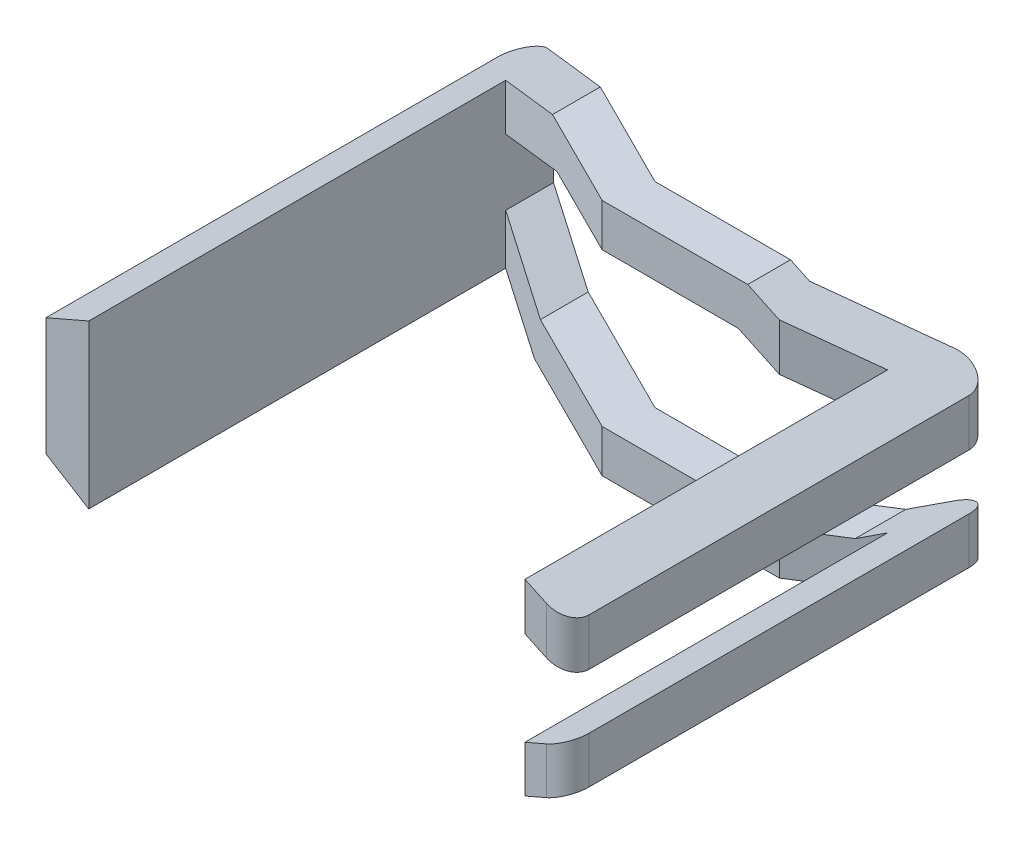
ISO-10303-21;
HEADER;
FILE_DESCRIPTION(('STEP AP214'),'2;1');
FILE_NAME('part.step','',(''),(''),'','','');
FILE_SCHEMA(('AUTOMOTIVE_DESIGN { 1 0 10303 214 1 1 1 1 }'));
ENDSEC;
DATA;
#1=APPLICATION_CONTEXT('core data for automotive mechanical design processes');
#2=APPLICATION_PROTOCOL_DEFINITION('international standard','automotive_design',2000,#1);
#3=PRODUCT_CONTEXT('',#1,'mechanical');
#4=PRODUCT('Part','Part','',(#3));
#5=PRODUCT_RELATED_PRODUCT_CATEGORY('part','',(#4));
#6=PRODUCT_DEFINITION_FORMATION('','',#4);
#7=PRODUCT_DEFINITION_CONTEXT('part definition',#1,'design');
#8=PRODUCT_DEFINITION('design','',#6,#7);
#9=PRODUCT_DEFINITION_SHAPE('','',#8);
#10=(LENGTH_UNIT() NAMED_UNIT(*) SI_UNIT(.MILLI.,.METRE.));
#11=(NAMED_UNIT(*) PLANE_ANGLE_UNIT() SI_UNIT($,.RADIAN.));
#12=(NAMED_UNIT(*) SI_UNIT($,.STERADIAN.) SOLID_ANGLE_UNIT());
#13=UNCERTAINTY_MEASURE_WITH_UNIT(LENGTH_MEASURE(1.E-05),#10,'distance_accuracy_value','');
#14=(GEOMETRIC_REPRESENTATION_CONTEXT(3) GLOBAL_UNCERTAINTY_ASSIGNED_CONTEXT((#13)) GLOBAL_UNIT_ASSIGNED_CONTEXT((#10,
#11,#12)) REPRESENTATION_CONTEXT('',''));
#15=CARTESIAN_POINT('',(0.,0.,0.));
#16=DIRECTION('',(0.,0.,1.));
#17=DIRECTION('',(1.,0.,0.));
#18=AXIS2_PLACEMENT_3D('',#15,#16,#17);
#19=CARTESIAN_POINT('',(0.,0.,125.));
#20=DIRECTION('',(0.,0.,1.));
#21=DIRECTION('',(1.,0.,0.));
#22=AXIS2_PLACEMENT_3D('',#19,#20,#21);
#23=PLANE('',#22);
#24=DIRECTION('',(0.,-1.,0.));
#25=VECTOR('',#24,1.);
#26=CARTESIAN_POINT('',(214.068694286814,95.6244972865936,125.));
#27=LINE('',#26,#25);
#28=CARTESIAN_POINT('',(214.068694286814,-10.360966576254,125.));
#29=VERTEX_POINT('',#28);
#30=CARTESIAN_POINT('',(214.068694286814,-32.1545691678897,125.));
#31=VERTEX_POINT('',#30);
#32=EDGE_CURVE('E570',#29,#31,#27,.T.);
#33=ORIENTED_EDGE('',*,*,#32,.T.);
#34=DIRECTION('',(0.917700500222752,0.397272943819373,0.));
#35=VECTOR('',#34,1.);
#36=CARTESIAN_POINT('',(45.5083961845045,-105.124395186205,125.));
#37=LINE('',#36,#35);
#38=CARTESIAN_POINT('',(224.068694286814,-27.8255648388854,125.));
#39=VERTEX_POINT('',#38);
#40=EDGE_CURVE('E468',#31,#39,#37,.T.);
#41=ORIENTED_EDGE('',*,*,#40,.T.);
#42=DIRECTION('',(0.,-1.,0.));
#43=VECTOR('',#42,1.);
#44=CARTESIAN_POINT('',(224.068694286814,95.6244972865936,125.));
#45=LINE('',#44,#43);
#46=CARTESIAN_POINT('',(224.068694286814,-6.03196224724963,125.));
#47=VERTEX_POINT('',#46);
#48=EDGE_CURVE('E575',#39,#47,#45,.F.);
#49=ORIENTED_EDGE('',*,*,#48,.T.);
#50=DIRECTION('',(0.917700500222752,0.397272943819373,0.));
#51=VECTOR('',#50,1.);
#52=CARTESIAN_POINT('',(37.562937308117,-86.7703851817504,125.));
#53=LINE('',#52,#51);
#54=EDGE_CURVE('E440',#29,#47,#53,.T.);
#55=ORIENTED_EDGE('',*,*,#54,.F.);
#56=EDGE_LOOP('',(#33,#41,#49,#55));
#57=FACE_BOUND('',#56,.T.);
#58=ADVANCED_FACE('F34',(#57),#23,.T.);
#59=CARTESIAN_POINT('',(214.068694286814,55.6673191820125,125.));
#60=VERTEX_POINT('',#59);
#61=CARTESIAN_POINT('',(214.068694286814,33.5647900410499,125.));
#62=VERTEX_POINT('',#61);
#63=EDGE_CURVE('E572',#60,#62,#27,.T.);
#64=ORIENTED_EDGE('',*,*,#63,.T.);
#65=DIRECTION('',(-0.904873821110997,0.425679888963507,0.));
#66=VECTOR('',#65,1.);
#67=CARTESIAN_POINT('',(51.7186753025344,109.939126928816,125.));
#68=LINE('',#67,#66);
#69=CARTESIAN_POINT('',(224.068694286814,28.8604889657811,125.));
#70=VERTEX_POINT('',#69);
#71=EDGE_CURVE('E443',#70,#62,#68,.T.);
#72=ORIENTED_EDGE('',*,*,#71,.F.);
#73=CARTESIAN_POINT('',(224.068694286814,50.9630181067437,125.));
#74=VERTEX_POINT('',#73);
#75=EDGE_CURVE('E573',#70,#74,#45,.F.);
#76=ORIENTED_EDGE('',*,*,#75,.T.);
#77=DIRECTION('',(-0.904873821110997,0.425679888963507,0.));
#78=VECTOR('',#77,1.);
#79=CARTESIAN_POINT('',(60.2322730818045,128.036603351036,125.));
#80=LINE('',#79,#78);
#81=EDGE_CURVE('E471',#74,#60,#80,.T.);
#82=ORIENTED_EDGE('',*,*,#81,.T.);
#83=EDGE_LOOP('',(#64,#72,#76,#82));
#84=FACE_BOUND('',#83,.T.);
#85=ADVANCED_FACE('F643',(#84),#23,.T.);
#86=DIRECTION('',(0.,-1.,0.));
#87=VECTOR('',#86,1.);
#88=CARTESIAN_POINT('',(10.,0.,125.));
#89=LINE('',#88,#87);
#90=CARTESIAN_POINT('',(10.,58.2565564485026,125.));
#91=VERTEX_POINT('',#90);
#92=CARTESIAN_POINT('',(10.,-17.8977166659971,125.));
#93=VERTEX_POINT('',#92);
#94=EDGE_CURVE('E56',#91,#93,#89,.T.);
#95=ORIENTED_EDGE('',*,*,#94,.F.);
#96=DIRECTION('',(-0.917700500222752,-0.397272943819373,0.));
#97=VECTOR('',#96,1.);
#98=CARTESIAN_POINT('',(-19.6607764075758,45.4163935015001,125.));
#99=LINE('',#98,#97);
#100=CARTESIAN_POINT('',(-10.,49.5985477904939,125.));
#101=VERTEX_POINT('',#100);
#102=EDGE_CURVE('E474',#91,#101,#99,.T.);
#103=ORIENTED_EDGE('',*,*,#102,.T.);
#104=DIRECTION('',(0.,-1.,0.));
#105=VECTOR('',#104,1.);
#106=CARTESIAN_POINT('',(-10.,0.,125.));
#107=LINE('',#106,#105);
#108=CARTESIAN_POINT('',(-10.,-5.5873048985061,125.));
#109=VERTEX_POINT('',#108);
#110=EDGE_CURVE('E476',#101,#109,#107,.T.);
#111=ORIENTED_EDGE('',*,*,#110,.T.);
#112=DIRECTION('',(0.851606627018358,-0.524181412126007,0.));
#113=VECTOR('',#112,1.);
#114=CARTESIAN_POINT('',(-5.24181412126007,-8.51606627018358,125.));
#115=LINE('',#114,#113);
#116=EDGE_CURVE('E465',#109,#93,#115,.T.);
#117=ORIENTED_EDGE('',*,*,#116,.T.);
#118=EDGE_LOOP('',(#95,#103,#111,#117));
#119=FACE_BOUND('',#118,.T.);
#120=ADVANCED_FACE('F645',(#119),#23,.T.);
#121=CARTESIAN_POINT('',(-5.24181412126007,-8.51606627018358,125.));
#122=DIRECTION('',(0.524181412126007,0.851606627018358,0.));
#123=DIRECTION('',(-0.851606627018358,0.524181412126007,0.));
#124=AXIS2_PLACEMENT_3D('',#121,#122,#123);
#125=PLANE('',#124);
#126=DIRECTION('',(-0.783597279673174,0.48232025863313,-0.39158967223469));
#127=VECTOR('',#126,1.);
#128=CARTESIAN_POINT('',(56.9497022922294,-46.7962250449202,-46.5990076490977));
#129=LINE('',#128,#127);
#130=CARTESIAN_POINT('',(36.7704872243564,-34.3755027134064,-56.6832338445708));
#131=VERTEX_POINT('',#130);
#132=CARTESIAN_POINT('',(10.,-17.8977166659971,-70.0613383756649));
#133=VERTEX_POINT('',#132);
#134=EDGE_CURVE('E49',#131,#133,#129,.T.);
#135=ORIENTED_EDGE('',*,*,#134,.T.);
#136=DIRECTION('',(0.,0.,1.));
#137=VECTOR('',#136,1.);
#138=CARTESIAN_POINT('',(10.,-17.8977166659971,125.));
#139=LINE('',#138,#137);
#140=EDGE_CURVE('E366',#133,#93,#139,.T.);
#141=ORIENTED_EDGE('',*,*,#140,.T.);
#142=ORIENTED_EDGE('',*,*,#116,.F.);
#143=DIRECTION('',(0.,0.,-1.));
#144=VECTOR('',#143,1.);
#145=CARTESIAN_POINT('',(-10.,-5.5873048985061,125.));
#146=LINE('',#145,#144);
#147=CARTESIAN_POINT('',(-10.,-5.5873048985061,-86.2378191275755));
#148=VERTEX_POINT('',#147);
#149=EDGE_CURVE('E478',#109,#148,#146,.T.);
#150=ORIENTED_EDGE('',*,*,#149,.T.);
#151=CARTESIAN_POINT('',(0.,-11.7425107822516,-86.2378191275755));
#152=DIRECTION('',(0.524181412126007,0.851606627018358,0.));
#153=DIRECTION('',(0.851606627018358,-0.524181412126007,0.));
#154=AXIS2_PLACEMENT_3D('',#151,#152,#153);
#155=ELLIPSE('',#154,11.7425107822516,10.);
#156=CARTESIAN_POINT('',(4.47022746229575,-14.494027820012,-95.1830450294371));
#157=VERTEX_POINT('',#156);
#158=EDGE_CURVE('E436',#157,#148,#155,.T.);
#159=ORIENTED_EDGE('',*,*,#158,.F.);
#160=DIRECTION('',(-0.783597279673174,0.48232025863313,-0.39158967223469));
#161=VECTOR('',#160,1.);
#162=CARTESIAN_POINT('',(63.8103138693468,-51.0190727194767,-65.5288264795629));
#163=LINE('',#162,#161);
#164=CARTESIAN_POINT('',(20.5240769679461,-24.3755027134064,-87.1604014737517));
#165=VERTEX_POINT('',#164);
#166=EDGE_CURVE('E362',#165,#157,#163,.T.);
#167=ORIENTED_EDGE('',*,*,#166,.F.);
#168=CARTESIAN_POINT('',(20.5240769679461,-24.3755027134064,-75.981253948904));
#169=DIRECTION('',(0.524181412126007,0.851606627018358,0.));
#170=DIRECTION('',(0.734485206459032,-0.452090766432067,0.506108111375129));
#171=AXIS2_PLACEMENT_3D('',#168,#169,#170);
#172=ELLIPSE('',#171,21.3268675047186,10.);
#173=CARTESIAN_POINT('',(36.7704872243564,-34.3755027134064,-67.8623813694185));
#174=VERTEX_POINT('',#173);
#175=EDGE_CURVE('E438',#174,#165,#172,.T.);
#176=ORIENTED_EDGE('',*,*,#175,.F.);
#177=DIRECTION('',(0.,0.,-1.));
#178=VECTOR('',#177,1.);
#179=CARTESIAN_POINT('',(36.7704872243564,-34.3755027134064,125.));
#180=LINE('',#179,#178);
#181=EDGE_CURVE('E299',#131,#174,#180,.T.);
#182=ORIENTED_EDGE('',*,*,#181,.F.);
#183=EDGE_LOOP('',(#135,#141,#142,#150,#159,#167,#176,#182));
#184=FACE_BOUND('',#183,.T.);
#185=ADVANCED_FACE('F36',(#184),#125,.F.);
#186=CARTESIAN_POINT('',(0.,-34.3755027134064,125.));
#187=DIRECTION('',(0.,1.,0.));
#188=DIRECTION('',(0.,0.,1.));
#189=AXIS2_PLACEMENT_3D('',#186,#187,#188);
#190=PLANE('',#189);
#191=DIRECTION('',(1.,0.,0.));
#192=VECTOR('',#191,1.);
#193=CARTESIAN_POINT('',(102.511333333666,-34.3755027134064,-25.0094899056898));
#194=LINE('',#193,#192);
#195=CARTESIAN_POINT('',(100.151779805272,-34.3755027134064,-25.0094899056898));
#196=VERTEX_POINT('',#195);
#197=CARTESIAN_POINT('',(183.037821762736,-34.3755027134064,-25.0094899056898));
#198=VERTEX_POINT('',#197);
#199=EDGE_CURVE('E550',#196,#198,#194,.T.);
#200=ORIENTED_EDGE('',*,*,#199,.F.);
#201=DIRECTION('',(0.894522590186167,0.,0.447022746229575));
#202=VECTOR('',#201,1.);
#203=CARTESIAN_POINT('',(-4.47022746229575,-34.3755027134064,-77.2925932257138));
#204=LINE('',#203,#202);
#205=EDGE_CURVE('E329',#131,#196,#204,.T.);
#206=ORIENTED_EDGE('',*,*,#205,.F.);
#207=ORIENTED_EDGE('',*,*,#181,.T.);
#208=DIRECTION('',(0.894522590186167,0.,0.447022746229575));
#209=VECTOR('',#208,1.);
#210=CARTESIAN_POINT('',(146.135168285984,-34.3755027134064,-13.209205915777));
#211=LINE('',#210,#209);
#212=CARTESIAN_POINT('',(102.511333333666,-34.3755027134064,-35.0094899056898));
#213=VERTEX_POINT('',#212);
#214=EDGE_CURVE('E289',#174,#213,#211,.T.);
#215=ORIENTED_EDGE('',*,*,#214,.T.);
#216=DIRECTION('',(1.,0.,0.));
#217=VECTOR('',#216,1.);
#218=CARTESIAN_POINT('',(164.899293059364,-34.3755027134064,-35.0094899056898));
#219=LINE('',#218,#217);
#220=CARTESIAN_POINT('',(180.140817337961,-34.3755027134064,-35.0094899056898));
#221=VERTEX_POINT('',#220);
#222=EDGE_CURVE('E277',#213,#221,#219,.T.);
#223=ORIENTED_EDGE('',*,*,#222,.T.);
#224=DIRECTION('',(0.845143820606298,0.,-0.53453898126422));
#225=VECTOR('',#224,1.);
#226=CARTESIAN_POINT('',(176.368632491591,-34.3755027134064,-32.623647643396));
#227=LINE('',#226,#225);
#228=CARTESIAN_POINT('',(208.93833779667,-34.3755027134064,-53.2234280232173));
#229=VERTEX_POINT('',#228);
#230=EDGE_CURVE('E288',#221,#229,#227,.T.);
#231=ORIENTED_EDGE('',*,*,#230,.T.);
#232=DIRECTION('',(0.,0.,-1.));
#233=VECTOR('',#232,1.);
#234=CARTESIAN_POINT('',(208.93833779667,-34.3755027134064,125.));
#235=LINE('',#234,#233);
#236=CARTESIAN_POINT('',(208.93833779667,-34.3755027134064,-41.3911223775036));
#237=VERTEX_POINT('',#236);
#238=EDGE_CURVE('E490',#237,#229,#235,.T.);
#239=ORIENTED_EDGE('',*,*,#238,.F.);
#240=DIRECTION('',(0.845143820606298,0.,-0.53453898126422));
#241=VECTOR('',#240,1.);
#242=CARTESIAN_POINT('',(185.486207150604,-34.3755027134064,-26.5580516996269));
#243=LINE('',#242,#241);
#244=EDGE_CURVE('E542',#198,#237,#243,.T.);
#245=ORIENTED_EDGE('',*,*,#244,.F.);
#246=EDGE_LOOP('',(#200,#206,#207,#215,#223,#231,#239,#245));
#247=FACE_BOUND('',#246,.T.);
#248=ADVANCED_FACE('F298',(#247),#190,.F.);
#249=CARTESIAN_POINT('',(45.5083961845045,-105.124395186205,125.));
#250=DIRECTION('',(-0.397272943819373,0.917700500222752,0.));
#251=DIRECTION('',(-0.917700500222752,-0.397272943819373,0.));
#252=AXIS2_PLACEMENT_3D('',#249,#250,#251);
#253=PLANE('',#252);
#254=ORIENTED_EDGE('',*,*,#40,.F.);
#255=DIRECTION('',(0.,0.,-1.));
#256=VECTOR('',#255,1.);
#257=CARTESIAN_POINT('',(214.068694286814,-32.1545691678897,125.));
#258=LINE('',#257,#256);
#259=CARTESIAN_POINT('',(214.068694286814,-32.1545691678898,-44.6359849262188));
#260=VERTEX_POINT('',#259);
#261=EDGE_CURVE('E432',#31,#260,#258,.T.);
#262=ORIENTED_EDGE('',*,*,#261,.T.);
#263=DIRECTION('',(-0.793691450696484,-0.34358937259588,0.501996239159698));
#264=VECTOR('',#263,1.);
#265=CARTESIAN_POINT('',(20.397542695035,-115.994894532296,77.8576990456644));
#266=LINE('',#265,#264);
#267=EDGE_CURVE('E410',#260,#237,#266,.T.);
#268=ORIENTED_EDGE('',*,*,#267,.T.);
#269=ORIENTED_EDGE('',*,*,#238,.T.);
#270=CARTESIAN_POINT('',(232.03833779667,-24.3755027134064,-67.8337821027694));
#271=DIRECTION('',(-0.397272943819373,0.917700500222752,0.));
#272=DIRECTION('',(0.755622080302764,0.327109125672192,-0.567481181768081));
#273=AXIS2_PLACEMENT_3D('',#270,#271,#272);
#274=ELLIPSE('',#273,29.7838194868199,10.);
#275=CARTESIAN_POINT('',(219.568977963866,-29.7734939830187,-69.9074879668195));
#276=VERTEX_POINT('',#275);
#277=EDGE_CURVE('E42',#276,#229,#274,.T.);
#278=ORIENTED_EDGE('',*,*,#277,.F.);
#279=CARTESIAN_POINT('',(225.326509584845,-27.2810560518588,-62.7931191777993));
#280=DIRECTION('',(-0.397272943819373,0.917700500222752,0.));
#281=DIRECTION('',(-0.917700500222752,-0.397272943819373,0.));
#282=AXIS2_PLACEMENT_3D('',#279,#280,#281);
#283=CIRCLE('',#282,9.48555008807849);
#284=CARTESIAN_POINT('',(232.03833779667,-24.3755027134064,-68.8333826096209));
#285=VERTEX_POINT('',#284);
#286=EDGE_CURVE('E11',#285,#276,#283,.T.);
#287=ORIENTED_EDGE('',*,*,#286,.F.);
#288=CARTESIAN_POINT('',(224.068694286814,-27.8255648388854,-62.7931191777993));
#289=DIRECTION('',(-0.397272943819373,0.917700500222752,0.));
#290=DIRECTION('',(-0.917700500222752,-0.397272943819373,0.));
#291=AXIS2_PLACEMENT_3D('',#288,#289,#290);
#292=ELLIPSE('',#291,10.8968012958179,10.);
#293=CARTESIAN_POINT('',(234.068694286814,-23.4965605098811,-62.7931191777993));
#294=VERTEX_POINT('',#293);
#295=EDGE_CURVE('E393',#294,#285,#292,.T.);
#296=ORIENTED_EDGE('',*,*,#295,.F.);
#297=DIRECTION('',(0.,0.,-1.));
#298=VECTOR('',#297,1.);
#299=CARTESIAN_POINT('',(234.068694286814,-23.4965605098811,125.));
#300=LINE('',#299,#298);
#301=CARTESIAN_POINT('',(234.068694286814,-23.4965605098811,115.));
#302=VERTEX_POINT('',#301);
#303=EDGE_CURVE('E425',#302,#294,#300,.T.);
#304=ORIENTED_EDGE('',*,*,#303,.F.);
#305=CARTESIAN_POINT('',(224.068694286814,-27.8255648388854,115.));
#306=DIRECTION('',(-0.397272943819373,0.917700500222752,0.));
#307=DIRECTION('',(-0.917700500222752,-0.397272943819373,0.));
#308=AXIS2_PLACEMENT_3D('',#305,#306,#307);
#309=ELLIPSE('',#308,10.8968012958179,10.);
#310=EDGE_CURVE('E400',#39,#302,#309,.T.);
#311=ORIENTED_EDGE('',*,*,#310,.F.);
#312=EDGE_LOOP('',(#254,#262,#268,#269,#278,#287,#296,#304,#311));
#313=FACE_BOUND('',#312,.T.);
#314=ADVANCED_FACE('F533',(#313),#253,.F.);
#315=CARTESIAN_POINT('',(60.2322730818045,128.036603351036,125.));
#316=DIRECTION('',(-0.425679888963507,-0.904873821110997,0.));
#317=DIRECTION('',(0.904873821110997,-0.425679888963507,0.));
#318=AXIS2_PLACEMENT_3D('',#315,#316,#317);
#319=PLANE('',#318);
#320=DIRECTION('',(0.785349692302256,-0.369452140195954,-0.496720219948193));
#321=VECTOR('',#320,1.);
#322=CARTESIAN_POINT('',(32.0136432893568,141.311496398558,70.5107145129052));
#323=LINE('',#322,#321);
#324=CARTESIAN_POINT('',(183.037821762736,70.2651758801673,-25.0094899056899));
#325=VERTEX_POINT('',#324);
#326=CARTESIAN_POINT('',(214.068694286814,55.6673191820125,-44.6359849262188));
#327=VERTEX_POINT('',#326);
#328=EDGE_CURVE('E408',#325,#327,#323,.T.);
#329=ORIENTED_EDGE('',*,*,#328,.T.);
#330=DIRECTION('',(0.,0.,1.));
#331=VECTOR('',#330,1.);
#332=CARTESIAN_POINT('',(214.068694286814,55.6673191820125,125.));
#333=LINE('',#332,#331);
#334=EDGE_CURVE('E430',#327,#60,#333,.T.);
#335=ORIENTED_EDGE('',*,*,#334,.T.);
#336=ORIENTED_EDGE('',*,*,#81,.F.);
#337=CARTESIAN_POINT('',(224.068694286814,50.9630181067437,115.));
#338=DIRECTION('',(-0.425679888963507,-0.904873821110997,0.));
#339=DIRECTION('',(0.904873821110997,-0.425679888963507,0.));
#340=AXIS2_PLACEMENT_3D('',#337,#338,#339);
#341=ELLIPSE('',#340,11.0512645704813,10.);
#342=CARTESIAN_POINT('',(234.068694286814,46.2587170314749,115.));
#343=VERTEX_POINT('',#342);
#344=EDGE_CURVE('E398',#343,#74,#341,.T.);
#345=ORIENTED_EDGE('',*,*,#344,.F.);
#346=DIRECTION('',(0.,0.,1.));
#347=VECTOR('',#346,1.);
#348=CARTESIAN_POINT('',(234.068694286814,46.2587170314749,125.));
#349=LINE('',#348,#347);
#350=CARTESIAN_POINT('',(234.068694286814,46.2587170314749,-62.7931191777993));
#351=VERTEX_POINT('',#350);
#352=EDGE_CURVE('E423',#351,#343,#349,.T.);
#353=ORIENTED_EDGE('',*,*,#352,.F.);
#354=CARTESIAN_POINT('',(224.068694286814,50.9630181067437,-62.7931191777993));
#355=DIRECTION('',(-0.425679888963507,-0.904873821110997,0.));
#356=DIRECTION('',(0.904873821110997,-0.425679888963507,0.));
#357=AXIS2_PLACEMENT_3D('',#354,#355,#356);
#358=ELLIPSE('',#357,11.0512645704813,10.);
#359=CARTESIAN_POINT('',(218.723304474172,53.4776504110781,-71.2445573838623));
#360=VERTEX_POINT('',#359);
#361=EDGE_CURVE('E391',#360,#351,#358,.T.);
#362=ORIENTED_EDGE('',*,*,#361,.F.);
#363=DIRECTION('',(0.785349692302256,-0.369452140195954,-0.496720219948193));
#364=VECTOR('',#363,1.);
#365=CARTESIAN_POINT('',(22.7821003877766,145.654292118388,52.6848958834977));
#366=LINE('',#365,#364);
#367=CARTESIAN_POINT('',(177.243812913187,72.9908520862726,-45.0094899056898));
#368=VERTEX_POINT('',#367);
#369=EDGE_CURVE('E418',#368,#360,#366,.T.);
#370=ORIENTED_EDGE('',*,*,#369,.F.);
#371=DIRECTION('',(0.904873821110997,-0.425679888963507,0.));
#372=VECTOR('',#371,1.);
#373=CARTESIAN_POINT('',(60.2322730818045,128.036603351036,-45.0094899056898));
#374=LINE('',#373,#372);
#375=CARTESIAN_POINT('',(168.285037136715,77.2053299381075,-45.0094899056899));
#376=VERTEX_POINT('',#375);
#377=EDGE_CURVE('E386',#376,#368,#374,.T.);
#378=ORIENTED_EDGE('',*,*,#377,.F.);
#379=DIRECTION('',(0.,0.,-1.));
#380=VECTOR('',#379,1.);
#381=CARTESIAN_POINT('',(168.285037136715,77.2053299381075,125.));
#382=LINE('',#381,#380);
#383=CARTESIAN_POINT('',(168.285037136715,77.2053299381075,-25.0094899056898));
#384=VERTEX_POINT('',#383);
#385=EDGE_CURVE('E487',#384,#376,#382,.T.);
#386=ORIENTED_EDGE('',*,*,#385,.F.);
#387=DIRECTION('',(0.904873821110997,-0.425679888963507,0.));
#388=VECTOR('',#387,1.);
#389=CARTESIAN_POINT('',(60.2322730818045,128.036603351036,-25.0094899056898));
#390=LINE('',#389,#388);
#391=EDGE_CURVE('E376',#384,#325,#390,.T.);
#392=ORIENTED_EDGE('',*,*,#391,.T.);
#393=EDGE_LOOP('',(#329,#335,#336,#345,#353,#362,#370,#378,#386,#392));
#394=FACE_BOUND('',#393,.T.);
#395=ADVANCED_FACE('F700',(#394),#319,.F.);
#396=CARTESIAN_POINT('',(0.,77.2053299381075,125.));
#397=DIRECTION('',(0.,-1.,0.));
#398=DIRECTION('',(0.,0.,-1.));
#399=AXIS2_PLACEMENT_3D('',#396,#397,#398);
#400=PLANE('',#399);
#401=DIRECTION('',(1.,0.,0.));
#402=VECTOR('',#401,1.);
#403=CARTESIAN_POINT('',(0.,77.2053299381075,-45.0094899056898));
#404=LINE('',#403,#402);
#405=CARTESIAN_POINT('',(104.87088686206,77.2053299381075,-45.0094899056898));
#406=VERTEX_POINT('',#405);
#407=EDGE_CURVE('E384',#406,#376,#404,.T.);
#408=ORIENTED_EDGE('',*,*,#407,.F.);
#409=DIRECTION('',(0.894522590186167,0.,0.447022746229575));
#410=VECTOR('',#409,1.);
#411=CARTESIAN_POINT('',(88.9383050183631,77.2053299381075,-52.9715319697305));
#412=LINE('',#411,#410);
#413=CARTESIAN_POINT('',(53.7716667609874,77.2053299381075,-70.5454729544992));
#414=VERTEX_POINT('',#413);
#415=EDGE_CURVE('E360',#414,#406,#412,.T.);
#416=ORIENTED_EDGE('',*,*,#415,.F.);
#417=DIRECTION('',(0.,0.,-1.));
#418=VECTOR('',#417,1.);
#419=CARTESIAN_POINT('',(53.7716667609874,77.2053299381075,125.));
#420=LINE('',#419,#418);
#421=CARTESIAN_POINT('',(53.7716667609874,77.2053299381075,-48.1871779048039));
#422=VERTEX_POINT('',#421);
#423=EDGE_CURVE('E484',#422,#414,#420,.T.);
#424=ORIENTED_EDGE('',*,*,#423,.F.);
#425=DIRECTION('',(0.894522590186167,0.,0.447022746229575));
#426=VECTOR('',#425,1.);
#427=CARTESIAN_POINT('',(79.9978500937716,77.2053299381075,-35.0810801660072));
#428=LINE('',#427,#426);
#429=CARTESIAN_POINT('',(100.151779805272,77.2053299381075,-25.0094899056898));
#430=VERTEX_POINT('',#429);
#431=EDGE_CURVE('E343',#422,#430,#428,.T.);
#432=ORIENTED_EDGE('',*,*,#431,.T.);
#433=DIRECTION('',(1.,0.,0.));
#434=VECTOR('',#433,1.);
#435=CARTESIAN_POINT('',(0.,77.2053299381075,-25.0094899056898));
#436=LINE('',#435,#434);
#437=EDGE_CURVE('E374',#430,#384,#436,.T.);
#438=ORIENTED_EDGE('',*,*,#437,.T.);
#439=ORIENTED_EDGE('',*,*,#385,.T.);
#440=EDGE_LOOP('',(#408,#416,#424,#432,#438,#439));
#441=FACE_BOUND('',#440,.T.);
#442=ADVANCED_FACE('F675',(#441),#400,.F.);
#443=CARTESIAN_POINT('',(-19.6607764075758,45.4163935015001,125.));
#444=DIRECTION('',(0.397272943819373,-0.917700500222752,0.));
#445=DIRECTION('',(0.917700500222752,0.397272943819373,0.));
#446=AXIS2_PLACEMENT_3D('',#443,#444,#445);
#447=PLANE('',#446);
#448=ORIENTED_EDGE('',*,*,#102,.F.);
#449=DIRECTION('',(0.,0.,-1.));
#450=VECTOR('',#449,1.);
#451=CARTESIAN_POINT('',(10.,58.2565564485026,125.));
#452=LINE('',#451,#450);
#453=CARTESIAN_POINT('',(10.,58.2565564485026,-70.0613383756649));
#454=VERTEX_POINT('',#453);
#455=EDGE_CURVE('E364',#91,#454,#452,.T.);
#456=ORIENTED_EDGE('',*,*,#455,.T.);
#457=DIRECTION('',(0.834163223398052,0.361109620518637,0.416859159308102));
#458=VECTOR('',#457,1.);
#459=CARTESIAN_POINT('',(53.3218251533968,77.0105933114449,-48.4119787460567));
#460=LINE('',#459,#458);
#461=EDGE_CURVE('E341',#454,#422,#460,.T.);
#462=ORIENTED_EDGE('',*,*,#461,.T.);
#463=ORIENTED_EDGE('',*,*,#423,.T.);
#464=DIRECTION('',(0.834163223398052,0.361109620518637,0.416859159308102));
#465=VECTOR('',#464,1.);
#466=CARTESIAN_POINT('',(61.0964433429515,80.3762288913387,-66.8850380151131));
#467=LINE('',#466,#465);
#468=CARTESIAN_POINT('',(4.47022746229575,55.8627155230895,-95.1830450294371));
#469=VERTEX_POINT('',#468);
#470=EDGE_CURVE('E358',#469,#414,#467,.T.);
#471=ORIENTED_EDGE('',*,*,#470,.F.);
#472=CARTESIAN_POINT('',(0.,53.9275521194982,-86.2378191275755));
#473=DIRECTION('',(0.397272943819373,-0.917700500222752,0.));
#474=DIRECTION('',(-0.917700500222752,-0.397272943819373,0.));
#475=AXIS2_PLACEMENT_3D('',#472,#473,#474);
#476=ELLIPSE('',#475,10.8968012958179,10.);
#477=CARTESIAN_POINT('',(-10.,49.5985477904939,-86.2378191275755));
#478=VERTEX_POINT('',#477);
#479=EDGE_CURVE('E434',#478,#469,#476,.T.);
#480=ORIENTED_EDGE('',*,*,#479,.F.);
#481=DIRECTION('',(0.,0.,-1.));
#482=VECTOR('',#481,1.);
#483=CARTESIAN_POINT('',(-10.,49.5985477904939,125.));
#484=LINE('',#483,#482);
#485=EDGE_CURVE('E481',#101,#478,#484,.T.);
#486=ORIENTED_EDGE('',*,*,#485,.F.);
#487=EDGE_LOOP('',(#448,#456,#462,#463,#471,#480,#486));
#488=FACE_BOUND('',#487,.T.);
#489=ADVANCED_FACE('F659',(#488),#447,.F.);
#490=CARTESIAN_POINT('',(-10.,0.,125.));
#491=DIRECTION('',(1.,0.,0.));
#492=DIRECTION('',(0.,0.,-1.));
#493=AXIS2_PLACEMENT_3D('',#490,#491,#492);
#494=PLANE('',#493);
#495=ORIENTED_EDGE('',*,*,#485,.T.);
#496=DIRECTION('',(0.,-1.,0.));
#497=VECTOR('',#496,1.);
#498=CARTESIAN_POINT('',(-10.,95.6244972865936,-86.2378191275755));
#499=LINE('',#498,#497);
#500=EDGE_CURVE('E521',#478,#148,#499,.T.);
#501=ORIENTED_EDGE('',*,*,#500,.T.);
#502=ORIENTED_EDGE('',*,*,#149,.F.);
#503=ORIENTED_EDGE('',*,*,#110,.F.);
#504=EDGE_LOOP('',(#495,#501,#502,#503));
#505=FACE_BOUND('',#504,.T.);
#506=ADVANCED_FACE('F730',(#505),#494,.F.);
#507=CARTESIAN_POINT('',(5.24181412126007,8.51606627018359,125.));
#508=DIRECTION('',(0.524181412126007,0.851606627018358,0.));
#509=DIRECTION('',(-0.851606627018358,0.524181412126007,0.));
#510=AXIS2_PLACEMENT_3D('',#507,#508,#509);
#511=PLANE('',#510);
#512=DIRECTION('',(0.,0.,-1.));
#513=VECTOR('',#512,1.);
#514=CARTESIAN_POINT('',(42.432396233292,-14.3755027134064,125.));
#515=LINE('',#514,#513);
#516=CARTESIAN_POINT('',(42.432396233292,-14.3755027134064,-53.8537892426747));
#517=VERTEX_POINT('',#516);
#518=CARTESIAN_POINT('',(42.432396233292,-14.3755027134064,-76.2120842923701));
#519=VERTEX_POINT('',#518);
#520=EDGE_CURVE('E462',#517,#519,#515,.T.);
#521=ORIENTED_EDGE('',*,*,#520,.T.);
#522=DIRECTION('',(-0.783597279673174,0.48232025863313,-0.39158967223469));
#523=VECTOR('',#522,1.);
#524=CARTESIAN_POINT('',(72.6863566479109,-32.997438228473,-61.0931721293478));
#525=LINE('',#524,#523);
#526=CARTESIAN_POINT('',(10.,5.58730489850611,-92.4196334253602));
#527=VERTEX_POINT('',#526);
#528=EDGE_CURVE('E352',#519,#527,#525,.T.);
#529=ORIENTED_EDGE('',*,*,#528,.T.);
#530=DIRECTION('',(0.,0.,-1.));
#531=VECTOR('',#530,1.);
#532=CARTESIAN_POINT('',(10.,5.58730489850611,125.));
#533=LINE('',#532,#531);
#534=CARTESIAN_POINT('',(10.,5.58730489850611,-70.0613383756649));
#535=VERTEX_POINT('',#534);
#536=EDGE_CURVE('E447',#535,#527,#533,.T.);
#537=ORIENTED_EDGE('',*,*,#536,.F.);
#538=DIRECTION('',(-0.783597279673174,0.48232025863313,-0.39158967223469));
#539=VECTOR('',#538,1.);
#540=CARTESIAN_POINT('',(65.8257450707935,-28.7745905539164,-42.1633532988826));
#541=LINE('',#540,#539);
#542=EDGE_CURVE('E338',#517,#535,#541,.T.);
#543=ORIENTED_EDGE('',*,*,#542,.F.);
#544=EDGE_LOOP('',(#521,#529,#537,#543));
#545=FACE_BOUND('',#544,.T.);
#546=ADVANCED_FACE('F721',(#545),#511,.T.);
#547=CARTESIAN_POINT('',(0.,-14.3755027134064,125.));
#548=DIRECTION('',(0.,1.,0.));
#549=DIRECTION('',(0.,0.,1.));
#550=AXIS2_PLACEMENT_3D('',#547,#548,#549);
#551=PLANE('',#550);
#552=DIRECTION('',(0.,0.,-1.));
#553=VECTOR('',#552,1.);
#554=CARTESIAN_POINT('',(204.795115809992,-14.3755027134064,125.));
#555=LINE('',#554,#553);
#556=CARTESIAN_POINT('',(204.795115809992,-14.3755027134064,-38.7706054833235));
#557=VERTEX_POINT('',#556);
#558=CARTESIAN_POINT('',(204.795115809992,-14.3755027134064,-62.435216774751));
#559=VERTEX_POINT('',#558);
#560=EDGE_CURVE('E459',#557,#559,#555,.T.);
#561=ORIENTED_EDGE('',*,*,#560,.T.);
#562=DIRECTION('',(-0.845143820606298,0.,0.53453898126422));
#563=VECTOR('',#562,1.);
#564=CARTESIAN_POINT('',(-26.1596656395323,-14.3755027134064,83.6397240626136));
#565=LINE('',#564,#563);
#566=CARTESIAN_POINT('',(177.243812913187,-14.3755027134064,-45.0094899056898));
#567=VERTEX_POINT('',#566);
#568=EDGE_CURVE('E415',#559,#567,#565,.T.);
#569=ORIENTED_EDGE('',*,*,#568,.T.);
#570=DIRECTION('',(-1.,0.,0.));
#571=VECTOR('',#570,1.);
#572=CARTESIAN_POINT('',(0.,-14.3755027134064,-45.0094899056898));
#573=LINE('',#572,#571);
#574=CARTESIAN_POINT('',(104.87088686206,-14.3755027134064,-45.0094899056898));
#575=VERTEX_POINT('',#574);
#576=EDGE_CURVE('E381',#567,#575,#573,.T.);
#577=ORIENTED_EDGE('',*,*,#576,.T.);
#578=DIRECTION('',(-0.894522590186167,0.,-0.447022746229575));
#579=VECTOR('',#578,1.);
#580=CARTESIAN_POINT('',(88.9383050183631,-14.3755027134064,-52.9715319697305));
#581=LINE('',#580,#579);
#582=EDGE_CURVE('E355',#575,#519,#581,.T.);
#583=ORIENTED_EDGE('',*,*,#582,.T.);
#584=ORIENTED_EDGE('',*,*,#520,.F.);
#585=DIRECTION('',(-0.894522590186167,0.,-0.447022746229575));
#586=VECTOR('',#585,1.);
#587=CARTESIAN_POINT('',(79.9978500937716,-14.3755027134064,-35.0810801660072));
#588=LINE('',#587,#586);
#589=CARTESIAN_POINT('',(100.151779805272,-14.3755027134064,-25.0094899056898));
#590=VERTEX_POINT('',#589);
#591=EDGE_CURVE('E335',#590,#517,#588,.T.);
#592=ORIENTED_EDGE('',*,*,#591,.F.);
#593=DIRECTION('',(-1.,0.,0.));
#594=VECTOR('',#593,1.);
#595=CARTESIAN_POINT('',(0.,-14.3755027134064,-25.0094899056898));
#596=LINE('',#595,#594);
#597=CARTESIAN_POINT('',(183.037821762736,-14.3755027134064,-25.0094899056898));
#598=VERTEX_POINT('',#597);
#599=EDGE_CURVE('E371',#598,#590,#596,.T.);
#600=ORIENTED_EDGE('',*,*,#599,.F.);
#601=DIRECTION('',(-0.845143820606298,0.,0.53453898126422));
#602=VECTOR('',#601,1.);
#603=CARTESIAN_POINT('',(-15.4688860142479,-14.3755027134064,100.54260047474));
#604=LINE('',#603,#602);
#605=EDGE_CURVE('E405',#557,#598,#604,.T.);
#606=ORIENTED_EDGE('',*,*,#605,.F.);
#607=EDGE_LOOP('',(#561,#569,#577,#583,#584,#592,#600,#606));
#608=FACE_BOUND('',#607,.T.);
#609=ADVANCED_FACE('F723',(#608),#551,.T.);
#610=CARTESIAN_POINT('',(37.562937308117,-86.7703851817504,125.));
#611=DIRECTION('',(-0.397272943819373,0.917700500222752,0.));
#612=DIRECTION('',(-0.917700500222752,-0.397272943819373,0.));
#613=AXIS2_PLACEMENT_3D('',#610,#611,#612);
#614=PLANE('',#613);
#615=DIRECTION('',(0.,0.,-1.));
#616=VECTOR('',#615,1.);
#617=CARTESIAN_POINT('',(214.068694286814,-10.360966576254,125.));
#618=LINE('',#617,#616);
#619=CARTESIAN_POINT('',(214.068694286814,-10.360966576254,-44.6359849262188));
#620=VERTEX_POINT('',#619);
#621=EDGE_CURVE('E427',#29,#620,#618,.T.);
#622=ORIENTED_EDGE('',*,*,#621,.F.);
#623=ORIENTED_EDGE('',*,*,#54,.T.);
#624=CARTESIAN_POINT('',(224.068694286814,-6.03196224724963,115.));
#625=DIRECTION('',(-0.397272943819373,0.917700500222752,0.));
#626=DIRECTION('',(-0.917700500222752,-0.397272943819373,0.));
#627=AXIS2_PLACEMENT_3D('',#624,#625,#626);
#628=ELLIPSE('',#627,10.8968012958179,10.);
#629=CARTESIAN_POINT('',(234.068694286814,-1.7029579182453,115.));
#630=VERTEX_POINT('',#629);
#631=EDGE_CURVE('E395',#47,#630,#628,.T.);
#632=ORIENTED_EDGE('',*,*,#631,.T.);
#633=DIRECTION('',(0.,0.,-1.));
#634=VECTOR('',#633,1.);
#635=CARTESIAN_POINT('',(234.068694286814,-1.7029579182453,125.));
#636=LINE('',#635,#634);
#637=CARTESIAN_POINT('',(234.068694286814,-1.7029579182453,-62.7931191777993));
#638=VERTEX_POINT('',#637);
#639=EDGE_CURVE('E420',#630,#638,#636,.T.);
#640=ORIENTED_EDGE('',*,*,#639,.T.);
#641=CARTESIAN_POINT('',(224.068694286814,-6.03196224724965,-62.7931191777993));
#642=DIRECTION('',(-0.397272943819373,0.917700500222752,0.));
#643=DIRECTION('',(-0.917700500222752,-0.397272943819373,0.));
#644=AXIS2_PLACEMENT_3D('',#641,#642,#643);
#645=ELLIPSE('',#644,10.8968012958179,10.);
#646=CARTESIAN_POINT('',(218.723304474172,-8.34598381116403,-71.2445573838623));
#647=VERTEX_POINT('',#646);
#648=EDGE_CURVE('E388',#638,#647,#645,.T.);
#649=ORIENTED_EDGE('',*,*,#648,.T.);
#650=DIRECTION('',(-0.793691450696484,-0.34358937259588,0.501996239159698));
#651=VECTOR('',#650,1.);
#652=CARTESIAN_POINT('',(5.02564724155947,-100.85579213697,63.9155481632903));
#653=LINE('',#652,#651);
#654=EDGE_CURVE('E412',#647,#559,#653,.T.);
#655=ORIENTED_EDGE('',*,*,#654,.T.);
#656=ORIENTED_EDGE('',*,*,#560,.F.);
#657=DIRECTION('',(-0.793691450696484,-0.34358937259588,0.501996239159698));
#658=VECTOR('',#657,1.);
#659=CARTESIAN_POINT('',(14.4543412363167,-96.774106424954,81.6166721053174));
#660=LINE('',#659,#658);
#661=EDGE_CURVE('E402',#620,#557,#660,.T.);
#662=ORIENTED_EDGE('',*,*,#661,.F.);
#663=EDGE_LOOP('',(#622,#623,#632,#640,#649,#655,#656,#662));
#664=FACE_BOUND('',#663,.T.);
#665=ADVANCED_FACE('F589',(#664),#614,.T.);
#666=CARTESIAN_POINT('',(51.7186753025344,109.939126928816,125.));
#667=DIRECTION('',(-0.425679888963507,-0.904873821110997,0.));
#668=DIRECTION('',(0.904873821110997,-0.425679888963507,0.));
#669=AXIS2_PLACEMENT_3D('',#666,#667,#668);
#670=PLANE('',#669);
#671=DIRECTION('',(0.,0.,1.));
#672=VECTOR('',#671,1.);
#673=CARTESIAN_POINT('',(214.068694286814,33.5647900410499,125.));
#674=LINE('',#673,#672);
#675=CARTESIAN_POINT('',(214.068694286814,33.5647900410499,-44.6359849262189));
#676=VERTEX_POINT('',#675);
#677=EDGE_CURVE('E518',#676,#62,#674,.T.);
#678=ORIENTED_EDGE('',*,*,#677,.F.);
#679=DIRECTION('',(0.785349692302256,-0.369452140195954,-0.496720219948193));
#680=VECTOR('',#679,1.);
#681=CARTESIAN_POINT('',(25.6006138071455,122.225849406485,74.5668457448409));
#682=LINE('',#681,#680);
#683=CARTESIAN_POINT('',(183.037821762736,48.1626467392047,-25.0094899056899));
#684=VERTEX_POINT('',#683);
#685=EDGE_CURVE('E515',#684,#676,#682,.T.);
#686=ORIENTED_EDGE('',*,*,#685,.F.);
#687=DIRECTION('',(0.904873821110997,-0.425679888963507,0.));
#688=VECTOR('',#687,1.);
#689=CARTESIAN_POINT('',(51.7186753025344,109.939126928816,-25.0094899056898));
#690=LINE('',#689,#688);
#691=CARTESIAN_POINT('',(163.81566090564,57.2053299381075,-25.0094899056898));
#692=VERTEX_POINT('',#691);
#693=EDGE_CURVE('E368',#692,#684,#690,.T.);
#694=ORIENTED_EDGE('',*,*,#693,.F.);
#695=DIRECTION('',(0.,0.,-1.));
#696=VECTOR('',#695,1.);
#697=CARTESIAN_POINT('',(163.81566090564,57.2053299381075,125.));
#698=LINE('',#697,#696);
#699=CARTESIAN_POINT('',(163.81566090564,57.2053299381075,-45.0094899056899));
#700=VERTEX_POINT('',#699);
#701=EDGE_CURVE('E456',#692,#700,#698,.T.);
#702=ORIENTED_EDGE('',*,*,#701,.T.);
#703=DIRECTION('',(0.904873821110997,-0.425679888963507,0.));
#704=VECTOR('',#703,1.);
#705=CARTESIAN_POINT('',(51.7186753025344,109.939126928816,-45.0094899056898));
#706=LINE('',#705,#704);
#707=CARTESIAN_POINT('',(177.243812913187,50.8883229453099,-45.0094899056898));
#708=VERTEX_POINT('',#707);
#709=EDGE_CURVE('E378',#700,#708,#706,.T.);
#710=ORIENTED_EDGE('',*,*,#709,.T.);
#711=DIRECTION('',(0.785349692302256,-0.369452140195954,-0.496720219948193));
#712=VECTOR('',#711,1.);
#713=CARTESIAN_POINT('',(16.3690709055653,126.568645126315,56.7410271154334));
#714=LINE('',#713,#712);
#715=CARTESIAN_POINT('',(218.723304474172,31.3751212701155,-71.2445573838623));
#716=VERTEX_POINT('',#715);
#717=EDGE_CURVE('E506',#708,#716,#714,.T.);
#718=ORIENTED_EDGE('',*,*,#717,.T.);
#719=CARTESIAN_POINT('',(224.068694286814,28.8604889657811,-62.7931191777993));
#720=DIRECTION('',(-0.425679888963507,-0.904873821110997,0.));
#721=DIRECTION('',(0.904873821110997,-0.425679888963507,0.));
#722=AXIS2_PLACEMENT_3D('',#719,#720,#721);
#723=ELLIPSE('',#722,11.0512645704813,10.);
#724=CARTESIAN_POINT('',(234.068694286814,24.1561878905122,-62.7931191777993));
#725=VERTEX_POINT('',#724);
#726=EDGE_CURVE('E503',#716,#725,#723,.T.);
#727=ORIENTED_EDGE('',*,*,#726,.T.);
#728=DIRECTION('',(0.,0.,1.));
#729=VECTOR('',#728,1.);
#730=CARTESIAN_POINT('',(234.068694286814,24.1561878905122,125.));
#731=LINE('',#730,#729);
#732=CARTESIAN_POINT('',(234.068694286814,24.1561878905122,115.));
#733=VERTEX_POINT('',#732);
#734=EDGE_CURVE('E509',#725,#733,#731,.T.);
#735=ORIENTED_EDGE('',*,*,#734,.T.);
#736=CARTESIAN_POINT('',(224.068694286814,28.8604889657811,115.));
#737=DIRECTION('',(-0.425679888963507,-0.904873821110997,0.));
#738=DIRECTION('',(0.904873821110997,-0.425679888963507,0.));
#739=AXIS2_PLACEMENT_3D('',#736,#737,#738);
#740=ELLIPSE('',#739,11.0512645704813,10.);
#741=EDGE_CURVE('E512',#733,#70,#740,.T.);
#742=ORIENTED_EDGE('',*,*,#741,.T.);
#743=ORIENTED_EDGE('',*,*,#71,.T.);
#744=EDGE_LOOP('',(#678,#686,#694,#702,#710,#718,#727,#735,#742,#743));
#745=FACE_BOUND('',#744,.T.);
#746=ADVANCED_FACE('F687',(#745),#670,.T.);
#747=CARTESIAN_POINT('',(0.,57.2053299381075,125.));
#748=DIRECTION('',(0.,-1.,0.));
#749=DIRECTION('',(0.,0.,-1.));
#750=AXIS2_PLACEMENT_3D('',#747,#748,#749);
#751=PLANE('',#750);
#752=DIRECTION('',(0.894522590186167,0.,0.447022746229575));
#753=VECTOR('',#752,1.);
#754=CARTESIAN_POINT('',(88.9383050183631,57.2053299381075,-52.9715319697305));
#755=LINE('',#754,#753);
#756=CARTESIAN_POINT('',(57.914888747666,57.2053299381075,-68.4749668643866));
#757=VERTEX_POINT('',#756);
#758=CARTESIAN_POINT('',(104.87088686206,57.2053299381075,-45.0094899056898));
#759=VERTEX_POINT('',#758);
#760=EDGE_CURVE('E349',#757,#759,#755,.T.);
#761=ORIENTED_EDGE('',*,*,#760,.T.);
#762=DIRECTION('',(1.,0.,0.));
#763=VECTOR('',#762,1.);
#764=CARTESIAN_POINT('',(0.,57.2053299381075,-45.0094899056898));
#765=LINE('',#764,#763);
#766=EDGE_CURVE('E500',#759,#700,#765,.T.);
#767=ORIENTED_EDGE('',*,*,#766,.T.);
#768=ORIENTED_EDGE('',*,*,#701,.F.);
#769=DIRECTION('',(1.,0.,0.));
#770=VECTOR('',#769,1.);
#771=CARTESIAN_POINT('',(0.,57.2053299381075,-25.0094899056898));
#772=LINE('',#771,#770);
#773=CARTESIAN_POINT('',(100.151779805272,57.2053299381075,-25.0094899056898));
#774=VERTEX_POINT('',#773);
#775=EDGE_CURVE('E497',#774,#692,#772,.T.);
#776=ORIENTED_EDGE('',*,*,#775,.F.);
#777=DIRECTION('',(0.894522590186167,0.,0.447022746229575));
#778=VECTOR('',#777,1.);
#779=CARTESIAN_POINT('',(79.9978500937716,57.2053299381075,-35.0810801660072));
#780=LINE('',#779,#778);
#781=CARTESIAN_POINT('',(57.914888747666,57.2053299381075,-46.1166718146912));
#782=VERTEX_POINT('',#781);
#783=EDGE_CURVE('E332',#782,#774,#780,.T.);
#784=ORIENTED_EDGE('',*,*,#783,.F.);
#785=DIRECTION('',(0.,0.,-1.));
#786=VECTOR('',#785,1.);
#787=CARTESIAN_POINT('',(57.914888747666,57.2053299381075,125.));
#788=LINE('',#787,#786);
#789=EDGE_CURVE('E453',#782,#757,#788,.T.);
#790=ORIENTED_EDGE('',*,*,#789,.T.);
#791=EDGE_LOOP('',(#761,#767,#768,#776,#784,#790));
#792=FACE_BOUND('',#791,.T.);
#793=ADVANCED_FACE('F685',(#792),#751,.T.);
#794=CARTESIAN_POINT('',(-11.7153175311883,27.062383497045,125.));
#795=DIRECTION('',(0.397272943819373,-0.917700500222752,0.));
#796=DIRECTION('',(0.917700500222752,0.397272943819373,0.));
#797=AXIS2_PLACEMENT_3D('',#794,#795,#796);
#798=PLANE('',#797);
#799=DIRECTION('',(0.,0.,-1.));
#800=VECTOR('',#799,1.);
#801=CARTESIAN_POINT('',(10.,36.4629538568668,125.));
#802=LINE('',#801,#800);
#803=CARTESIAN_POINT('',(10.,36.4629538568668,-70.0613383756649));
#804=VERTEX_POINT('',#803);
#805=CARTESIAN_POINT('',(10.,36.4629538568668,-92.4196334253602));
#806=VERTEX_POINT('',#805);
#807=EDGE_CURVE('E450',#804,#806,#802,.T.);
#808=ORIENTED_EDGE('',*,*,#807,.T.);
#809=DIRECTION('',(0.834163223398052,0.361109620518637,0.416859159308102));
#810=VECTOR('',#809,1.);
#811=CARTESIAN_POINT('',(67.6612074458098,61.4245155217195,-63.6044066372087));
#812=LINE('',#811,#810);
#813=EDGE_CURVE('E346',#806,#757,#812,.T.);
#814=ORIENTED_EDGE('',*,*,#813,.T.);
#815=ORIENTED_EDGE('',*,*,#789,.F.);
#816=DIRECTION('',(0.834163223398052,0.361109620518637,0.416859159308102));
#817=VECTOR('',#816,1.);
#818=CARTESIAN_POINT('',(59.8865892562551,58.0588799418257,-45.1313473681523));
#819=LINE('',#818,#817);
#820=EDGE_CURVE('E320',#804,#782,#819,.T.);
#821=ORIENTED_EDGE('',*,*,#820,.F.);
#822=EDGE_LOOP('',(#808,#814,#815,#821));
#823=FACE_BOUND('',#822,.T.);
#824=ADVANCED_FACE('F718',(#823),#798,.T.);
#825=CARTESIAN_POINT('',(10.,0.,125.));
#826=DIRECTION('',(1.,0.,0.));
#827=DIRECTION('',(0.,0.,-1.));
#828=AXIS2_PLACEMENT_3D('',#825,#826,#827);
#829=PLANE('',#828);
#830=ORIENTED_EDGE('',*,*,#94,.T.);
#831=ORIENTED_EDGE('',*,*,#140,.F.);
#832=DIRECTION('',(0.,-1.,0.));
#833=VECTOR('',#832,1.);
#834=CARTESIAN_POINT('',(10.,95.6244972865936,-70.0613383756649));
#835=LINE('',#834,#833);
#836=EDGE_CURVE('E560',#535,#133,#835,.T.);
#837=ORIENTED_EDGE('',*,*,#836,.F.);
#838=ORIENTED_EDGE('',*,*,#536,.T.);
#839=DIRECTION('',(0.,1.,0.));
#840=VECTOR('',#839,1.);
#841=CARTESIAN_POINT('',(10.,0.,-92.4196334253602));
#842=LINE('',#841,#840);
#843=EDGE_CURVE('E494',#527,#806,#842,.T.);
#844=ORIENTED_EDGE('',*,*,#843,.T.);
#845=ORIENTED_EDGE('',*,*,#807,.F.);
#846=EDGE_CURVE('E563',#454,#804,#835,.T.);
#847=ORIENTED_EDGE('',*,*,#846,.F.);
#848=ORIENTED_EDGE('',*,*,#455,.F.);
#849=EDGE_LOOP('',(#830,#831,#837,#838,#844,#845,#847,#848));
#850=FACE_BOUND('',#849,.T.);
#851=ADVANCED_FACE('F640',(#850),#829,.T.);
#852=CARTESIAN_POINT('',(224.068694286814,95.6244972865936,115.));
#853=DIRECTION('',(0.,-1.,0.));
#854=DIRECTION('',(-1.,0.,0.));
#855=AXIS2_PLACEMENT_3D('',#852,#853,#854);
#856=CYLINDRICAL_SURFACE('',#855,10.);
#857=DIRECTION('',(0.,-1.,0.));
#858=VECTOR('',#857,1.);
#859=CARTESIAN_POINT('',(234.068694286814,95.6244972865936,115.));
#860=LINE('',#859,#858);
#861=EDGE_CURVE('E300',#343,#733,#860,.T.);
#862=ORIENTED_EDGE('',*,*,#861,.F.);
#863=ORIENTED_EDGE('',*,*,#344,.T.);
#864=ORIENTED_EDGE('',*,*,#75,.F.);
#865=ORIENTED_EDGE('',*,*,#741,.F.);
#866=EDGE_LOOP('',(#862,#863,#864,#865));
#867=FACE_BOUND('',#866,.T.);
#868=ADVANCED_FACE('F628',(#867),#856,.T.);
#869=CARTESIAN_POINT('',(224.068694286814,95.6244972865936,-62.7931191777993));
#870=DIRECTION('',(0.,-1.,0.));
#871=DIRECTION('',(-1.,0.,0.));
#872=AXIS2_PLACEMENT_3D('',#869,#870,#871);
#873=CYLINDRICAL_SURFACE('',#872,10.);
#874=DIRECTION('',(0.,-1.,0.));
#875=VECTOR('',#874,1.);
#876=CARTESIAN_POINT('',(218.723304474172,95.6244972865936,-71.2445573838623));
#877=LINE('',#876,#875);
#878=EDGE_CURVE('E310',#360,#716,#877,.T.);
#879=ORIENTED_EDGE('',*,*,#878,.F.);
#880=ORIENTED_EDGE('',*,*,#361,.T.);
#881=DIRECTION('',(0.,-1.,0.));
#882=VECTOR('',#881,1.);
#883=CARTESIAN_POINT('',(234.068694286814,95.6244972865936,-62.7931191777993));
#884=LINE('',#883,#882);
#885=EDGE_CURVE('E576',#725,#351,#884,.F.);
#886=ORIENTED_EDGE('',*,*,#885,.F.);
#887=ORIENTED_EDGE('',*,*,#726,.F.);
#888=EDGE_LOOP('',(#879,#880,#886,#887));
#889=FACE_BOUND('',#888,.T.);
#890=ADVANCED_FACE('F639',(#889),#873,.T.);
#891=CARTESIAN_POINT('',(4.47022746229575,95.6244972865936,-95.1830450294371));
#892=DIRECTION('',(0.447022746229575,0.,-0.894522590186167));
#893=DIRECTION('',(-0.894522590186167,0.,-0.447022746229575));
#894=AXIS2_PLACEMENT_3D('',#891,#892,#893);
#895=PLANE('',#894);
#896=DIRECTION('',(0.894522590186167,0.,0.447022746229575));
#897=VECTOR('',#896,1.);
#898=CARTESIAN_POINT('',(4.47022746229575,-24.3755027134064,-95.1830450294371));
#899=LINE('',#898,#897);
#900=CARTESIAN_POINT('',(104.87088686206,-24.3755027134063,-45.0094899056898));
#901=VERTEX_POINT('',#900);
#902=EDGE_CURVE('E295',#901,#165,#899,.F.);
#903=ORIENTED_EDGE('',*,*,#902,.T.);
#904=ORIENTED_EDGE('',*,*,#166,.T.);
#905=DIRECTION('',(0.,-1.,0.));
#906=VECTOR('',#905,1.);
#907=CARTESIAN_POINT('',(4.47022746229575,95.6244972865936,-95.1830450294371));
#908=LINE('',#907,#906);
#909=EDGE_CURVE('E317',#157,#469,#908,.F.);
#910=ORIENTED_EDGE('',*,*,#909,.T.);
#911=ORIENTED_EDGE('',*,*,#470,.T.);
#912=ORIENTED_EDGE('',*,*,#415,.T.);
#913=DIRECTION('',(0.,-1.,0.));
#914=VECTOR('',#913,1.);
#915=CARTESIAN_POINT('',(104.87088686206,95.6244972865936,-45.0094899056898));
#916=LINE('',#915,#914);
#917=EDGE_CURVE('E566',#406,#759,#916,.T.);
#918=ORIENTED_EDGE('',*,*,#917,.T.);
#919=ORIENTED_EDGE('',*,*,#760,.F.);
#920=ORIENTED_EDGE('',*,*,#813,.F.);
#921=ORIENTED_EDGE('',*,*,#843,.F.);
#922=ORIENTED_EDGE('',*,*,#528,.F.);
#923=ORIENTED_EDGE('',*,*,#582,.F.);
#924=EDGE_CURVE('E564',#575,#901,#916,.T.);
#925=ORIENTED_EDGE('',*,*,#924,.T.);
#926=EDGE_LOOP('',(#903,#904,#910,#911,#912,#918,#919,#920,#921,#922,#923,#925));
#927=FACE_BOUND('',#926,.T.);
#928=ADVANCED_FACE('F604',(#927),#895,.T.);
#929=CARTESIAN_POINT('',(102.511333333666,95.6244972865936,-45.0094899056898));
#930=DIRECTION('',(0.,0.,-1.));
#931=DIRECTION('',(-1.,0.,0.));
#932=AXIS2_PLACEMENT_3D('',#929,#930,#931);
#933=PLANE('',#932);
#934=ORIENTED_EDGE('',*,*,#407,.T.);
#935=ORIENTED_EDGE('',*,*,#377,.T.);
#936=DIRECTION('',(0.,-1.,0.));
#937=VECTOR('',#936,1.);
#938=CARTESIAN_POINT('',(177.243812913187,95.6244972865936,-45.0094899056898));
#939=LINE('',#938,#937);
#940=EDGE_CURVE('E569',#368,#708,#939,.T.);
#941=ORIENTED_EDGE('',*,*,#940,.T.);
#942=ORIENTED_EDGE('',*,*,#709,.F.);
#943=ORIENTED_EDGE('',*,*,#766,.F.);
#944=ORIENTED_EDGE('',*,*,#917,.F.);
#945=EDGE_LOOP('',(#934,#935,#941,#942,#943,#944));
#946=FACE_BOUND('',#945,.T.);
#947=ADVANCED_FACE('F680',(#946),#933,.T.);
#948=CARTESIAN_POINT('',(174.795427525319,95.6244972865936,-43.4609281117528));
#949=DIRECTION('',(-0.53453898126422,0.,-0.845143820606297));
#950=DIRECTION('',(-0.845143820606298,0.,0.53453898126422));
#951=AXIS2_PLACEMENT_3D('',#948,#949,#950);
#952=PLANE('',#951);
#953=ORIENTED_EDGE('',*,*,#940,.F.);
#954=ORIENTED_EDGE('',*,*,#369,.T.);
#955=ORIENTED_EDGE('',*,*,#878,.T.);
#956=ORIENTED_EDGE('',*,*,#717,.F.);
#957=EDGE_LOOP('',(#953,#954,#955,#956));
#958=FACE_BOUND('',#957,.T.);
#959=ADVANCED_FACE('F635',(#958),#952,.T.);
#960=CARTESIAN_POINT('',(234.068694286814,95.6244972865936,-62.7931191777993));
#961=DIRECTION('',(1.,0.,0.));
#962=DIRECTION('',(0.,0.,-1.));
#963=AXIS2_PLACEMENT_3D('',#960,#961,#962);
#964=PLANE('',#963);
#965=ORIENTED_EDGE('',*,*,#885,.T.);
#966=ORIENTED_EDGE('',*,*,#352,.T.);
#967=ORIENTED_EDGE('',*,*,#861,.T.);
#968=ORIENTED_EDGE('',*,*,#734,.F.);
#969=EDGE_LOOP('',(#965,#966,#967,#968));
#970=FACE_BOUND('',#969,.T.);
#971=ADVANCED_FACE('F633',(#970),#964,.T.);
#972=EDGE_CURVE('E578',#294,#638,#884,.F.);
#973=ORIENTED_EDGE('',*,*,#972,.F.);
#974=ORIENTED_EDGE('',*,*,#295,.T.);
#975=CARTESIAN_POINT('',(224.068694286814,-24.3755027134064,-62.7931191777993));
#976=DIRECTION('',(0.,-1.,0.));
#977=DIRECTION('',(-1.,0.,0.));
#978=AXIS2_PLACEMENT_3D('',#975,#976,#977);
#979=CIRCLE('',#978,10.);
#980=CARTESIAN_POINT('',(218.723304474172,-24.3755027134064,-71.2445573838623));
#981=VERTEX_POINT('',#980);
#982=EDGE_CURVE('E326',#285,#981,#979,.F.);
#983=ORIENTED_EDGE('',*,*,#982,.T.);
#984=EDGE_CURVE('E308',#647,#981,#877,.T.);
#985=ORIENTED_EDGE('',*,*,#984,.F.);
#986=ORIENTED_EDGE('',*,*,#648,.F.);
#987=EDGE_LOOP('',(#973,#974,#983,#985,#986));
#988=FACE_BOUND('',#987,.T.);
#989=ADVANCED_FACE('F616',(#988),#873,.T.);
#990=ORIENTED_EDGE('',*,*,#568,.F.);
#991=ORIENTED_EDGE('',*,*,#654,.F.);
#992=ORIENTED_EDGE('',*,*,#984,.T.);
#993=DIRECTION('',(0.845143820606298,0.,-0.53453898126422));
#994=VECTOR('',#993,1.);
#995=CARTESIAN_POINT('',(174.795427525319,-24.3755027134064,-43.4609281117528));
#996=LINE('',#995,#994);
#997=CARTESIAN_POINT('',(177.243812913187,-24.3755027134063,-45.0094899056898));
#998=VERTEX_POINT('',#997);
#999=EDGE_CURVE('E311',#981,#998,#996,.F.);
#1000=ORIENTED_EDGE('',*,*,#999,.T.);
#1001=EDGE_CURVE('E567',#567,#998,#939,.T.);
#1002=ORIENTED_EDGE('',*,*,#1001,.F.);
#1003=EDGE_LOOP('',(#990,#991,#992,#1000,#1002));
#1004=FACE_BOUND('',#1003,.T.);
#1005=ADVANCED_FACE('F611',(#1004),#952,.T.);
#1006=ORIENTED_EDGE('',*,*,#48,.F.);
#1007=ORIENTED_EDGE('',*,*,#310,.T.);
#1008=EDGE_CURVE('E303',#630,#302,#860,.T.);
#1009=ORIENTED_EDGE('',*,*,#1008,.F.);
#1010=ORIENTED_EDGE('',*,*,#631,.F.);
#1011=EDGE_LOOP('',(#1006,#1007,#1009,#1010));
#1012=FACE_BOUND('',#1011,.T.);
#1013=ADVANCED_FACE('F625',(#1012),#856,.T.);
#1014=ORIENTED_EDGE('',*,*,#1008,.T.);
#1015=ORIENTED_EDGE('',*,*,#303,.T.);
#1016=ORIENTED_EDGE('',*,*,#972,.T.);
#1017=ORIENTED_EDGE('',*,*,#639,.F.);
#1018=EDGE_LOOP('',(#1014,#1015,#1016,#1017));
#1019=FACE_BOUND('',#1018,.T.);
#1020=ADVANCED_FACE('F623',(#1019),#964,.T.);
#1021=ORIENTED_EDGE('',*,*,#576,.F.);
#1022=ORIENTED_EDGE('',*,*,#1001,.T.);
#1023=DIRECTION('',(1.,0.,0.));
#1024=VECTOR('',#1023,1.);
#1025=CARTESIAN_POINT('',(102.511333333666,-24.3755027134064,-45.0094899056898));
#1026=LINE('',#1025,#1024);
#1027=EDGE_CURVE('E314',#998,#901,#1026,.F.);
#1028=ORIENTED_EDGE('',*,*,#1027,.T.);
#1029=ORIENTED_EDGE('',*,*,#924,.F.);
#1030=EDGE_LOOP('',(#1021,#1022,#1028,#1029));
#1031=FACE_BOUND('',#1030,.T.);
#1032=ADVANCED_FACE('F608',(#1031),#933,.T.);
#1033=CARTESIAN_POINT('',(0.,95.6244972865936,-86.2378191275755));
#1034=DIRECTION('',(0.,-1.,0.));
#1035=DIRECTION('',(-1.,0.,0.));
#1036=AXIS2_PLACEMENT_3D('',#1033,#1034,#1035);
#1037=CYLINDRICAL_SURFACE('',#1036,10.);
#1038=ORIENTED_EDGE('',*,*,#909,.F.);
#1039=ORIENTED_EDGE('',*,*,#158,.T.);
#1040=ORIENTED_EDGE('',*,*,#500,.F.);
#1041=ORIENTED_EDGE('',*,*,#479,.T.);
#1042=EDGE_LOOP('',(#1038,#1039,#1040,#1041));
#1043=FACE_BOUND('',#1042,.T.);
#1044=ADVANCED_FACE('F794',(#1043),#1037,.T.);
#1045=CARTESIAN_POINT('',(176.368632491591,-24.3755027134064,-32.623647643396));
#1046=DIRECTION('',(0.845143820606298,0.,-0.53453898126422));
#1047=DIRECTION('',(-0.53453898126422,0.,-0.845143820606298));
#1048=AXIS2_PLACEMENT_3D('',#1045,#1046,#1047);
#1049=CYLINDRICAL_SURFACE('',#1048,10.);
#1050=CARTESIAN_POINT('',(224.068694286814,-24.3755027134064,-62.7931191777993));
#1051=DIRECTION('',(0.845143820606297,0.,-0.534538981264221));
#1052=DIRECTION('',(-0.534538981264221,0.,-0.845143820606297));
#1053=AXIS2_PLACEMENT_3D('',#1050,#1051,#1052);
#1054=CIRCLE('',#1053,10.);
#1055=EDGE_CURVE('E323',#981,#276,#1054,.F.);
#1056=ORIENTED_EDGE('',*,*,#1055,.T.);
#1057=ORIENTED_EDGE('',*,*,#277,.T.);
#1058=ORIENTED_EDGE('',*,*,#230,.F.);
#1059=CARTESIAN_POINT('',(180.140817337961,-24.3755027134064,-35.0094899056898));
#1060=DIRECTION('',(0.960506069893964,0.,-0.278259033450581));
#1061=DIRECTION('',(-0.27825903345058,0.,-0.960506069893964));
#1062=AXIS2_PLACEMENT_3D('',#1059,#1060,#1061);
#1063=ELLIPSE('',#1062,10.4111783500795,10.);
#1064=EDGE_CURVE('E284',#998,#221,#1063,.F.);
#1065=ORIENTED_EDGE('',*,*,#1064,.F.);
#1066=ORIENTED_EDGE('',*,*,#999,.F.);
#1067=EDGE_LOOP('',(#1056,#1057,#1058,#1065,#1066));
#1068=FACE_BOUND('',#1067,.T.);
#1069=ADVANCED_FACE('F525',(#1068),#1049,.T.);
#1070=CARTESIAN_POINT('',(224.068694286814,-24.3755027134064,-62.7931191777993));
#1071=DIRECTION('',(1.,0.,0.));
#1072=DIRECTION('',(0.,0.,-1.));
#1073=AXIS2_PLACEMENT_3D('',#1070,#1071,#1072);
#1074=SPHERICAL_SURFACE('',#1073,10.);
#1075=ORIENTED_EDGE('',*,*,#982,.F.);
#1076=ORIENTED_EDGE('',*,*,#286,.T.);
#1077=ORIENTED_EDGE('',*,*,#1055,.F.);
#1078=EDGE_LOOP('',(#1075,#1076,#1077));
#1079=FACE_BOUND('',#1078,.T.);
#1080=ADVANCED_FACE('F619',(#1079),#1074,.T.);
#1081=CARTESIAN_POINT('',(146.135168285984,-24.3755027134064,-13.209205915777));
#1082=DIRECTION('',(0.894522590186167,0.,0.447022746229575));
#1083=DIRECTION('',(0.447022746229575,0.,-0.894522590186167));
#1084=AXIS2_PLACEMENT_3D('',#1081,#1082,#1083);
#1085=CYLINDRICAL_SURFACE('',#1084,10.);
#1086=ORIENTED_EDGE('',*,*,#214,.F.);
#1087=ORIENTED_EDGE('',*,*,#175,.T.);
#1088=ORIENTED_EDGE('',*,*,#902,.F.);
#1089=CARTESIAN_POINT('',(102.511333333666,-24.3755027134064,-35.0094899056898));
#1090=DIRECTION('',(0.973273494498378,0.,0.229649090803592));
#1091=DIRECTION('',(0.229649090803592,0.,-0.973273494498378));
#1092=AXIS2_PLACEMENT_3D('',#1089,#1090,#1091);
#1093=ELLIPSE('',#1092,10.2746042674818,10.);
#1094=EDGE_CURVE('E281',#901,#213,#1093,.F.);
#1095=ORIENTED_EDGE('',*,*,#1094,.T.);
#1096=EDGE_LOOP('',(#1086,#1087,#1088,#1095));
#1097=FACE_BOUND('',#1096,.T.);
#1098=ADVANCED_FACE('F292',(#1097),#1085,.T.);
#1099=CARTESIAN_POINT('',(164.899293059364,-24.3755027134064,-35.0094899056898));
#1100=DIRECTION('',(1.,0.,0.));
#1101=DIRECTION('',(0.,0.,-1.));
#1102=AXIS2_PLACEMENT_3D('',#1099,#1100,#1101);
#1103=CYLINDRICAL_SURFACE('',#1102,10.);
#1104=ORIENTED_EDGE('',*,*,#1064,.T.);
#1105=ORIENTED_EDGE('',*,*,#222,.F.);
#1106=ORIENTED_EDGE('',*,*,#1094,.F.);
#1107=ORIENTED_EDGE('',*,*,#1027,.F.);
#1108=EDGE_LOOP('',(#1104,#1105,#1106,#1107));
#1109=FACE_BOUND('',#1108,.T.);
#1110=ADVANCED_FACE('F279',(#1109),#1103,.T.);
#1111=CARTESIAN_POINT('',(-4.47022746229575,95.6244972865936,-77.2925932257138));
#1112=DIRECTION('',(0.447022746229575,0.,-0.894522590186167));
#1113=DIRECTION('',(-0.894522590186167,0.,-0.447022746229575));
#1114=AXIS2_PLACEMENT_3D('',#1111,#1112,#1113);
#1115=PLANE('',#1114);
#1116=ORIENTED_EDGE('',*,*,#431,.F.);
#1117=ORIENTED_EDGE('',*,*,#461,.F.);
#1118=ORIENTED_EDGE('',*,*,#846,.T.);
#1119=ORIENTED_EDGE('',*,*,#820,.T.);
#1120=ORIENTED_EDGE('',*,*,#783,.T.);
#1121=DIRECTION('',(0.,-1.,0.));
#1122=VECTOR('',#1121,1.);
#1123=CARTESIAN_POINT('',(100.151779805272,95.6244972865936,-25.0094899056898));
#1124=LINE('',#1123,#1122);
#1125=EDGE_CURVE('E559',#430,#774,#1124,.T.);
#1126=ORIENTED_EDGE('',*,*,#1125,.F.);
#1127=EDGE_LOOP('',(#1116,#1117,#1118,#1119,#1120,#1126));
#1128=FACE_BOUND('',#1127,.T.);
#1129=ADVANCED_FACE('F668',(#1128),#1115,.F.);
#1130=CARTESIAN_POINT('',(102.511333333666,95.6244972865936,-25.0094899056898));
#1131=DIRECTION('',(0.,0.,-1.));
#1132=DIRECTION('',(-1.,0.,0.));
#1133=AXIS2_PLACEMENT_3D('',#1130,#1131,#1132);
#1134=PLANE('',#1133);
#1135=ORIENTED_EDGE('',*,*,#391,.F.);
#1136=ORIENTED_EDGE('',*,*,#437,.F.);
#1137=ORIENTED_EDGE('',*,*,#1125,.T.);
#1138=ORIENTED_EDGE('',*,*,#775,.T.);
#1139=ORIENTED_EDGE('',*,*,#693,.T.);
#1140=DIRECTION('',(0.,-1.,0.));
#1141=VECTOR('',#1140,1.);
#1142=CARTESIAN_POINT('',(183.037821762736,95.6244972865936,-25.0094899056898));
#1143=LINE('',#1142,#1141);
#1144=EDGE_CURVE('E555',#325,#684,#1143,.T.);
#1145=ORIENTED_EDGE('',*,*,#1144,.F.);
#1146=EDGE_LOOP('',(#1135,#1136,#1137,#1138,#1139,#1145));
#1147=FACE_BOUND('',#1146,.T.);
#1148=ADVANCED_FACE('F692',(#1147),#1134,.F.);
#1149=CARTESIAN_POINT('',(185.486207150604,95.6244972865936,-26.5580516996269));
#1150=DIRECTION('',(-0.53453898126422,0.,-0.845143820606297));
#1151=DIRECTION('',(-0.845143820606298,0.,0.53453898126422));
#1152=AXIS2_PLACEMENT_3D('',#1149,#1150,#1151);
#1153=PLANE('',#1152);
#1154=ORIENTED_EDGE('',*,*,#328,.F.);
#1155=ORIENTED_EDGE('',*,*,#1144,.T.);
#1156=ORIENTED_EDGE('',*,*,#685,.T.);
#1157=DIRECTION('',(0.,-1.,0.));
#1158=VECTOR('',#1157,1.);
#1159=CARTESIAN_POINT('',(214.068694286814,95.6244972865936,-44.6359849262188));
#1160=LINE('',#1159,#1158);
#1161=EDGE_CURVE('E546',#327,#676,#1160,.T.);
#1162=ORIENTED_EDGE('',*,*,#1161,.F.);
#1163=EDGE_LOOP('',(#1154,#1155,#1156,#1162));
#1164=FACE_BOUND('',#1163,.T.);
#1165=ADVANCED_FACE('F696',(#1164),#1153,.F.);
#1166=CARTESIAN_POINT('',(214.068694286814,95.6244972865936,-62.7931191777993));
#1167=DIRECTION('',(1.,0.,0.));
#1168=DIRECTION('',(0.,0.,-1.));
#1169=AXIS2_PLACEMENT_3D('',#1166,#1167,#1168);
#1170=PLANE('',#1169);
#1171=ORIENTED_EDGE('',*,*,#334,.F.);
#1172=ORIENTED_EDGE('',*,*,#1161,.T.);
#1173=ORIENTED_EDGE('',*,*,#677,.T.);
#1174=ORIENTED_EDGE('',*,*,#63,.F.);
#1175=EDGE_LOOP('',(#1171,#1172,#1173,#1174));
#1176=FACE_BOUND('',#1175,.T.);
#1177=ADVANCED_FACE('F705',(#1176),#1170,.F.);
#1178=ORIENTED_EDGE('',*,*,#261,.F.);
#1179=ORIENTED_EDGE('',*,*,#32,.F.);
#1180=ORIENTED_EDGE('',*,*,#621,.T.);
#1181=EDGE_CURVE('E540',#620,#260,#1160,.T.);
#1182=ORIENTED_EDGE('',*,*,#1181,.T.);
#1183=EDGE_LOOP('',(#1178,#1179,#1180,#1182));
#1184=FACE_BOUND('',#1183,.T.);
#1185=ADVANCED_FACE('F544',(#1184),#1170,.F.);
#1186=ORIENTED_EDGE('',*,*,#267,.F.);
#1187=ORIENTED_EDGE('',*,*,#1181,.F.);
#1188=ORIENTED_EDGE('',*,*,#661,.T.);
#1189=ORIENTED_EDGE('',*,*,#605,.T.);
#1190=EDGE_CURVE('E549',#598,#198,#1143,.T.);
#1191=ORIENTED_EDGE('',*,*,#1190,.T.);
#1192=ORIENTED_EDGE('',*,*,#244,.T.);
#1193=EDGE_LOOP('',(#1186,#1187,#1188,#1189,#1191,#1192));
#1194=FACE_BOUND('',#1193,.T.);
#1195=ADVANCED_FACE('F539',(#1194),#1153,.F.);
#1196=ORIENTED_EDGE('',*,*,#1190,.F.);
#1197=ORIENTED_EDGE('',*,*,#599,.T.);
#1198=EDGE_CURVE('E556',#590,#196,#1124,.T.);
#1199=ORIENTED_EDGE('',*,*,#1198,.T.);
#1200=ORIENTED_EDGE('',*,*,#199,.T.);
#1201=EDGE_LOOP('',(#1196,#1197,#1199,#1200));
#1202=FACE_BOUND('',#1201,.T.);
#1203=ADVANCED_FACE('F595',(#1202),#1134,.F.);
#1204=ORIENTED_EDGE('',*,*,#134,.F.);
#1205=ORIENTED_EDGE('',*,*,#205,.T.);
#1206=ORIENTED_EDGE('',*,*,#1198,.F.);
#1207=ORIENTED_EDGE('',*,*,#591,.T.);
#1208=ORIENTED_EDGE('',*,*,#542,.T.);
#1209=ORIENTED_EDGE('',*,*,#836,.T.);
#1210=EDGE_LOOP('',(#1204,#1205,#1206,#1207,#1208,#1209));
#1211=FACE_BOUND('',#1210,.T.);
#1212=ADVANCED_FACE('F600',(#1211),#1115,.F.);
#1213=CLOSED_SHELL('',(#58,#85,#120,#185,#248,#314,#395,#442,#489,#506,#546,#609,#665,#746,#793,
#824,#851,#868,#890,#928,#947,#959,#971,#989,#1005,#1013,#1020,#1032,#1044,#1069,#1080,#1098,
#1110,#1129,#1148,#1165,#1177,#1185,#1195,#1203,#1212));
#1214=MANIFOLD_SOLID_BREP('B2',#1213);
#1215=ADVANCED_BREP_SHAPE_REPRESENTATION('',(#18,#1214),#14);
#1216=SHAPE_DEFINITION_REPRESENTATION(#9,#1215);
ENDSEC;
END-ISO-10303-21;
